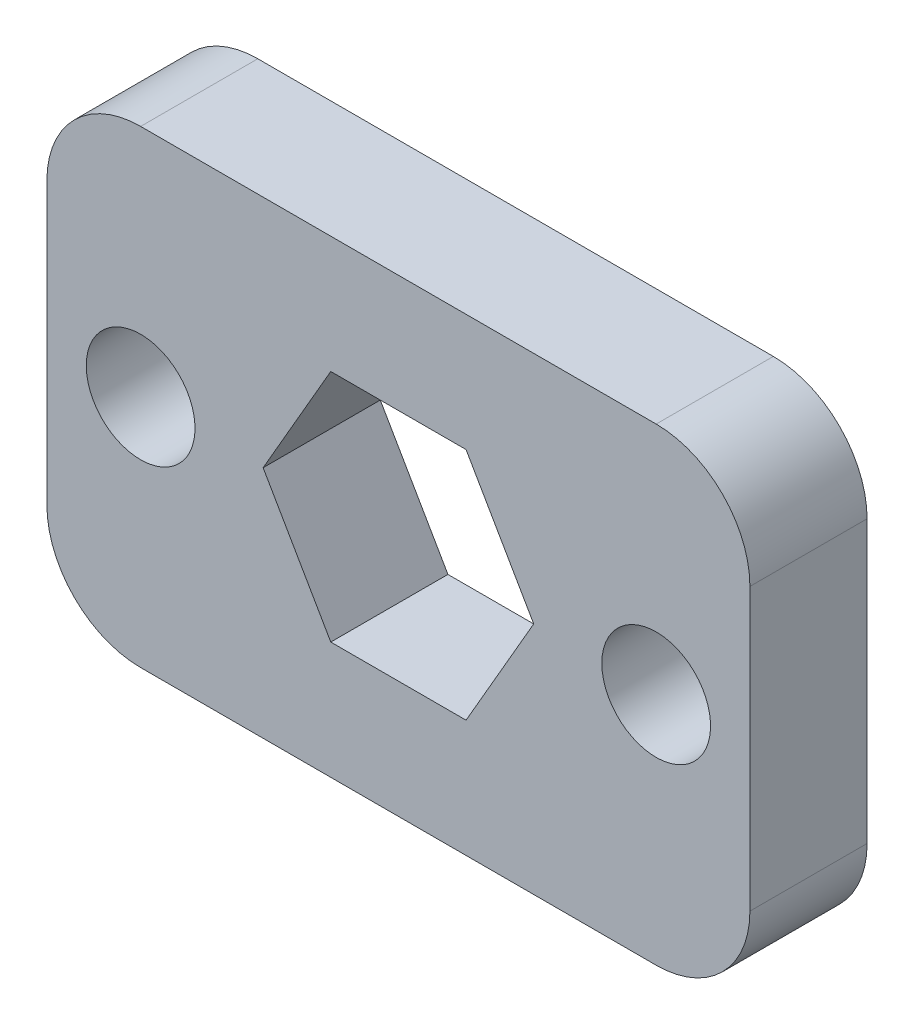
ISO-10303-21;
HEADER;
FILE_DESCRIPTION(('STEP AP214'),'2;1');
FILE_NAME('part.step','',(''),(''),'','','');
FILE_SCHEMA(('AUTOMOTIVE_DESIGN { 1 0 10303 214 1 1 1 1 }'));
ENDSEC;
DATA;
#1=APPLICATION_CONTEXT('core data for automotive mechanical design processes');
#2=APPLICATION_PROTOCOL_DEFINITION('international standard','automotive_design',2000,#1);
#3=PRODUCT_CONTEXT('',#1,'mechanical');
#4=PRODUCT('Part','Part','',(#3));
#5=PRODUCT_RELATED_PRODUCT_CATEGORY('part','',(#4));
#6=PRODUCT_DEFINITION_FORMATION('','',#4);
#7=PRODUCT_DEFINITION_CONTEXT('part definition',#1,'design');
#8=PRODUCT_DEFINITION('design','',#6,#7);
#9=PRODUCT_DEFINITION_SHAPE('','',#8);
#10=(LENGTH_UNIT() NAMED_UNIT(*) SI_UNIT(.MILLI.,.METRE.));
#11=(NAMED_UNIT(*) PLANE_ANGLE_UNIT() SI_UNIT($,.RADIAN.));
#12=(NAMED_UNIT(*) SI_UNIT($,.STERADIAN.) SOLID_ANGLE_UNIT());
#13=UNCERTAINTY_MEASURE_WITH_UNIT(LENGTH_MEASURE(1.E-05),#10,'distance_accuracy_value','');
#14=(GEOMETRIC_REPRESENTATION_CONTEXT(3) GLOBAL_UNCERTAINTY_ASSIGNED_CONTEXT((#13)) GLOBAL_UNIT_ASSIGNED_CONTEXT((#10,
#11,#12)) REPRESENTATION_CONTEXT('',''));
#15=CARTESIAN_POINT('',(0.,0.,0.));
#16=DIRECTION('',(0.,0.,1.));
#17=DIRECTION('',(1.,0.,0.));
#18=AXIS2_PLACEMENT_3D('',#15,#16,#17);
#19=CARTESIAN_POINT('',(0.,0.,-3.175));
#20=DIRECTION('',(0.,0.,1.));
#21=DIRECTION('',(1.,0.,0.));
#22=AXIS2_PLACEMENT_3D('',#19,#20,#21);
#23=PLANE('',#22);
#24=CARTESIAN_POINT('',(-2.54,6.35,-3.175));
#25=DIRECTION('',(0.,0.,-1.));
#26=DIRECTION('',(-1.,0.,0.));
#27=AXIS2_PLACEMENT_3D('',#24,#25,#26);
#28=CIRCLE('',#27,1.47319999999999);
#29=CARTESIAN_POINT('',(-4.01319999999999,6.35,-3.175));
#30=VERTEX_POINT('',#29);
#31=EDGE_CURVE('E454',#30,#30,#28,.T.);
#32=ORIENTED_EDGE('',*,*,#31,.F.);
#33=EDGE_LOOP('',(#32));
#34=FACE_BOUND('',#33,.T.);
#35=CARTESIAN_POINT('',(-16.51,6.35,-3.175));
#36=DIRECTION('',(0.,0.,-1.));
#37=DIRECTION('',(-1.,0.,0.));
#38=AXIS2_PLACEMENT_3D('',#35,#36,#37);
#39=CIRCLE('',#38,1.47319999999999);
#40=CARTESIAN_POINT('',(-17.9832,6.35,-3.175));
#41=VERTEX_POINT('',#40);
#42=EDGE_CURVE('E450',#41,#41,#39,.T.);
#43=ORIENTED_EDGE('',*,*,#42,.F.);
#44=EDGE_LOOP('',(#43));
#45=FACE_BOUND('',#44,.T.);
#46=DIRECTION('',(-1.,0.,0.));
#47=VECTOR('',#46,1.);
#48=CARTESIAN_POINT('',(0.,0.,-3.175));
#49=LINE('',#48,#47);
#50=CARTESIAN_POINT('',(-2.54,0.,-3.175));
#51=VERTEX_POINT('',#50);
#52=CARTESIAN_POINT('',(-16.51,0.,-3.175));
#53=VERTEX_POINT('',#52);
#54=EDGE_CURVE('E200',#51,#53,#49,.T.);
#55=ORIENTED_EDGE('',*,*,#54,.T.);
#56=CARTESIAN_POINT('',(-16.51,2.54,-3.175));
#57=DIRECTION('',(0.,0.,1.));
#58=DIRECTION('',(1.,0.,0.));
#59=AXIS2_PLACEMENT_3D('',#56,#57,#58);
#60=CIRCLE('',#59,2.54);
#61=CARTESIAN_POINT('',(-19.05,2.54,-3.175));
#62=VERTEX_POINT('',#61);
#63=EDGE_CURVE('E240',#53,#62,#60,.F.);
#64=ORIENTED_EDGE('',*,*,#63,.T.);
#65=DIRECTION('',(0.,1.,0.));
#66=VECTOR('',#65,1.);
#67=CARTESIAN_POINT('',(-19.05,0.,-3.175));
#68=LINE('',#67,#66);
#69=CARTESIAN_POINT('',(-19.05,10.16,-3.175));
#70=VERTEX_POINT('',#69);
#71=EDGE_CURVE('E204',#62,#70,#68,.T.);
#72=ORIENTED_EDGE('',*,*,#71,.T.);
#73=CARTESIAN_POINT('',(-16.51,10.16,-3.175));
#74=DIRECTION('',(0.,0.,1.));
#75=DIRECTION('',(1.,0.,0.));
#76=AXIS2_PLACEMENT_3D('',#73,#74,#75);
#77=CIRCLE('',#76,2.54);
#78=CARTESIAN_POINT('',(-16.51,12.7,-3.175));
#79=VERTEX_POINT('',#78);
#80=EDGE_CURVE('E57',#70,#79,#77,.F.);
#81=ORIENTED_EDGE('',*,*,#80,.T.);
#82=DIRECTION('',(1.,0.,0.));
#83=VECTOR('',#82,1.);
#84=CARTESIAN_POINT('',(0.,12.7,-3.175));
#85=LINE('',#84,#83);
#86=CARTESIAN_POINT('',(-2.54,12.7,-3.175));
#87=VERTEX_POINT('',#86);
#88=EDGE_CURVE('E206',#79,#87,#85,.T.);
#89=ORIENTED_EDGE('',*,*,#88,.T.);
#90=CARTESIAN_POINT('',(-2.54,10.16,-3.175));
#91=DIRECTION('',(0.,0.,1.));
#92=DIRECTION('',(1.,0.,0.));
#93=AXIS2_PLACEMENT_3D('',#90,#91,#92);
#94=CIRCLE('',#93,2.54);
#95=CARTESIAN_POINT('',(0.,10.16,-3.175));
#96=VERTEX_POINT('',#95);
#97=EDGE_CURVE('E235',#87,#96,#94,.F.);
#98=ORIENTED_EDGE('',*,*,#97,.T.);
#99=DIRECTION('',(0.,-1.,0.));
#100=VECTOR('',#99,1.);
#101=CARTESIAN_POINT('',(0.,0.,-3.175));
#102=LINE('',#101,#100);
#103=CARTESIAN_POINT('',(0.,2.54,-3.175));
#104=VERTEX_POINT('',#103);
#105=EDGE_CURVE('E197',#96,#104,#102,.T.);
#106=ORIENTED_EDGE('',*,*,#105,.T.);
#107=CARTESIAN_POINT('',(-2.54,2.54,-3.175));
#108=DIRECTION('',(0.,0.,1.));
#109=DIRECTION('',(1.,0.,0.));
#110=AXIS2_PLACEMENT_3D('',#107,#108,#109);
#111=CIRCLE('',#110,2.54);
#112=EDGE_CURVE('E238',#104,#51,#111,.F.);
#113=ORIENTED_EDGE('',*,*,#112,.T.);
#114=EDGE_LOOP('',(#55,#64,#72,#81,#89,#98,#106,#113));
#115=FACE_BOUND('',#114,.T.);
#116=DIRECTION('',(-0.499999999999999,0.866025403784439,0.));
#117=VECTOR('',#116,1.);
#118=CARTESIAN_POINT('',(-11.3580871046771,3.175,-3.175));
#119=LINE('',#118,#117);
#120=CARTESIAN_POINT('',(-11.3580871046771,3.175,-3.175));
#121=VERTEX_POINT('',#120);
#122=CARTESIAN_POINT('',(-13.1911742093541,6.35,-3.175));
#123=VERTEX_POINT('',#122);
#124=EDGE_CURVE('E139',#121,#123,#119,.T.);
#125=ORIENTED_EDGE('',*,*,#124,.F.);
#126=DIRECTION('',(-1.,0.,0.));
#127=VECTOR('',#126,1.);
#128=CARTESIAN_POINT('',(-7.69191289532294,3.175,-3.175));
#129=LINE('',#128,#127);
#130=CARTESIAN_POINT('',(-7.69191289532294,3.175,-3.175));
#131=VERTEX_POINT('',#130);
#132=EDGE_CURVE('E172',#131,#121,#129,.T.);
#133=ORIENTED_EDGE('',*,*,#132,.F.);
#134=DIRECTION('',(-0.5,-0.866025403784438,0.));
#135=VECTOR('',#134,1.);
#136=CARTESIAN_POINT('',(-5.85882579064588,6.35,-3.175));
#137=LINE('',#136,#135);
#138=CARTESIAN_POINT('',(-5.85882579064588,6.35,-3.175));
#139=VERTEX_POINT('',#138);
#140=EDGE_CURVE('E169',#139,#131,#137,.T.);
#141=ORIENTED_EDGE('',*,*,#140,.F.);
#142=DIRECTION('',(0.499999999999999,-0.866025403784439,0.));
#143=VECTOR('',#142,1.);
#144=CARTESIAN_POINT('',(-7.69191289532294,9.525,-3.175));
#145=LINE('',#144,#143);
#146=CARTESIAN_POINT('',(-7.69191289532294,9.525,-3.175));
#147=VERTEX_POINT('',#146);
#148=EDGE_CURVE('E164',#147,#139,#145,.T.);
#149=ORIENTED_EDGE('',*,*,#148,.F.);
#150=DIRECTION('',(1.,0.,0.));
#151=VECTOR('',#150,1.);
#152=CARTESIAN_POINT('',(-11.3580871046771,9.525,-3.175));
#153=LINE('',#152,#151);
#154=CARTESIAN_POINT('',(-11.3580871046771,9.525,-3.175));
#155=VERTEX_POINT('',#154);
#156=EDGE_CURVE('E162',#155,#147,#153,.T.);
#157=ORIENTED_EDGE('',*,*,#156,.F.);
#158=DIRECTION('',(0.500000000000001,0.866025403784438,0.));
#159=VECTOR('',#158,1.);
#160=CARTESIAN_POINT('',(-13.1911742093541,6.35,-3.175));
#161=LINE('',#160,#159);
#162=EDGE_CURVE('E149',#123,#155,#161,.T.);
#163=ORIENTED_EDGE('',*,*,#162,.F.);
#164=EDGE_LOOP('',(#125,#133,#141,#149,#157,#163));
#165=FACE_BOUND('',#164,.T.);
#166=ADVANCED_FACE('F36',(#34,#45,#115,#165),#23,.F.);
#167=CARTESIAN_POINT('',(0.,0.,0.));
#168=DIRECTION('',(0.,0.,1.));
#169=DIRECTION('',(1.,0.,0.));
#170=AXIS2_PLACEMENT_3D('',#167,#168,#169);
#171=PLANE('',#170);
#172=CARTESIAN_POINT('',(-2.54,6.35,0.));
#173=DIRECTION('',(0.,0.,-1.));
#174=DIRECTION('',(-1.,0.,0.));
#175=AXIS2_PLACEMENT_3D('',#172,#173,#174);
#176=CIRCLE('',#175,1.4732);
#177=CARTESIAN_POINT('',(-4.0132,6.35,0.));
#178=VERTEX_POINT('',#177);
#179=EDGE_CURVE('E451',#178,#178,#176,.T.);
#180=ORIENTED_EDGE('',*,*,#179,.T.);
#181=EDGE_LOOP('',(#180));
#182=FACE_BOUND('',#181,.T.);
#183=CARTESIAN_POINT('',(-16.51,6.35,0.));
#184=DIRECTION('',(0.,0.,-1.));
#185=DIRECTION('',(-1.,0.,0.));
#186=AXIS2_PLACEMENT_3D('',#183,#184,#185);
#187=CIRCLE('',#186,1.4732);
#188=CARTESIAN_POINT('',(-17.9832,6.35,0.));
#189=VERTEX_POINT('',#188);
#190=EDGE_CURVE('E176',#189,#189,#187,.T.);
#191=ORIENTED_EDGE('',*,*,#190,.T.);
#192=EDGE_LOOP('',(#191));
#193=FACE_BOUND('',#192,.T.);
#194=DIRECTION('',(0.,1.,0.));
#195=VECTOR('',#194,1.);
#196=CARTESIAN_POINT('',(-19.05,0.,0.));
#197=LINE('',#196,#195);
#198=CARTESIAN_POINT('',(-19.05,2.54,0.));
#199=VERTEX_POINT('',#198);
#200=CARTESIAN_POINT('',(-19.05,10.16,0.));
#201=VERTEX_POINT('',#200);
#202=EDGE_CURVE('E214',#199,#201,#197,.T.);
#203=ORIENTED_EDGE('',*,*,#202,.F.);
#204=CARTESIAN_POINT('',(-16.51,2.54,0.));
#205=DIRECTION('',(0.,0.,1.));
#206=DIRECTION('',(1.,0.,0.));
#207=AXIS2_PLACEMENT_3D('',#204,#205,#206);
#208=CIRCLE('',#207,2.54);
#209=CARTESIAN_POINT('',(-16.51,0.,0.));
#210=VERTEX_POINT('',#209);
#211=EDGE_CURVE('E228',#199,#210,#208,.T.);
#212=ORIENTED_EDGE('',*,*,#211,.T.);
#213=DIRECTION('',(-1.,0.,0.));
#214=VECTOR('',#213,1.);
#215=CARTESIAN_POINT('',(0.,0.,0.));
#216=LINE('',#215,#214);
#217=CARTESIAN_POINT('',(-2.54,0.,0.));
#218=VERTEX_POINT('',#217);
#219=EDGE_CURVE('E211',#218,#210,#216,.T.);
#220=ORIENTED_EDGE('',*,*,#219,.F.);
#221=CARTESIAN_POINT('',(-2.54,2.54,0.));
#222=DIRECTION('',(0.,0.,1.));
#223=DIRECTION('',(1.,0.,0.));
#224=AXIS2_PLACEMENT_3D('',#221,#222,#223);
#225=CIRCLE('',#224,2.54);
#226=CARTESIAN_POINT('',(0.,2.54,0.));
#227=VERTEX_POINT('',#226);
#228=EDGE_CURVE('E226',#218,#227,#225,.T.);
#229=ORIENTED_EDGE('',*,*,#228,.T.);
#230=DIRECTION('',(0.,-1.,0.));
#231=VECTOR('',#230,1.);
#232=CARTESIAN_POINT('',(0.,0.,0.));
#233=LINE('',#232,#231);
#234=CARTESIAN_POINT('',(0.,10.16,0.));
#235=VERTEX_POINT('',#234);
#236=EDGE_CURVE('E157',#235,#227,#233,.T.);
#237=ORIENTED_EDGE('',*,*,#236,.F.);
#238=CARTESIAN_POINT('',(-2.54,10.16,0.));
#239=DIRECTION('',(0.,0.,1.));
#240=DIRECTION('',(1.,0.,0.));
#241=AXIS2_PLACEMENT_3D('',#238,#239,#240);
#242=CIRCLE('',#241,2.54);
#243=CARTESIAN_POINT('',(-2.54,12.7,0.));
#244=VERTEX_POINT('',#243);
#245=EDGE_CURVE('E222',#235,#244,#242,.T.);
#246=ORIENTED_EDGE('',*,*,#245,.T.);
#247=DIRECTION('',(1.,0.,0.));
#248=VECTOR('',#247,1.);
#249=CARTESIAN_POINT('',(0.,12.7,0.));
#250=LINE('',#249,#248);
#251=CARTESIAN_POINT('',(-16.51,12.7,0.));
#252=VERTEX_POINT('',#251);
#253=EDGE_CURVE('E201',#252,#244,#250,.T.);
#254=ORIENTED_EDGE('',*,*,#253,.F.);
#255=CARTESIAN_POINT('',(-16.51,10.16,0.));
#256=DIRECTION('',(0.,0.,1.));
#257=DIRECTION('',(1.,0.,0.));
#258=AXIS2_PLACEMENT_3D('',#255,#256,#257);
#259=CIRCLE('',#258,2.54);
#260=EDGE_CURVE('E224',#252,#201,#259,.T.);
#261=ORIENTED_EDGE('',*,*,#260,.T.);
#262=EDGE_LOOP('',(#203,#212,#220,#229,#237,#246,#254,#261));
#263=FACE_BOUND('',#262,.T.);
#264=DIRECTION('',(-1.,0.,0.));
#265=VECTOR('',#264,1.);
#266=CARTESIAN_POINT('',(-7.69191289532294,3.175,0.));
#267=LINE('',#266,#265);
#268=CARTESIAN_POINT('',(-7.69191289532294,3.175,0.));
#269=VERTEX_POINT('',#268);
#270=CARTESIAN_POINT('',(-11.3580871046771,3.175,0.));
#271=VERTEX_POINT('',#270);
#272=EDGE_CURVE('E150',#269,#271,#267,.T.);
#273=ORIENTED_EDGE('',*,*,#272,.T.);
#274=DIRECTION('',(-0.499999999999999,0.866025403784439,0.));
#275=VECTOR('',#274,1.);
#276=CARTESIAN_POINT('',(-11.3580871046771,3.175,0.));
#277=LINE('',#276,#275);
#278=CARTESIAN_POINT('',(-13.1911742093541,6.35,0.));
#279=VERTEX_POINT('',#278);
#280=EDGE_CURVE('E174',#271,#279,#277,.T.);
#281=ORIENTED_EDGE('',*,*,#280,.T.);
#282=DIRECTION('',(0.500000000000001,0.866025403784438,0.));
#283=VECTOR('',#282,1.);
#284=CARTESIAN_POINT('',(-13.1911742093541,6.35,0.));
#285=LINE('',#284,#283);
#286=CARTESIAN_POINT('',(-11.3580871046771,9.525,0.));
#287=VERTEX_POINT('',#286);
#288=EDGE_CURVE('E156',#279,#287,#285,.T.);
#289=ORIENTED_EDGE('',*,*,#288,.T.);
#290=DIRECTION('',(1.,0.,0.));
#291=VECTOR('',#290,1.);
#292=CARTESIAN_POINT('',(-11.3580871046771,9.525,0.));
#293=LINE('',#292,#291);
#294=CARTESIAN_POINT('',(-7.69191289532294,9.525,0.));
#295=VERTEX_POINT('',#294);
#296=EDGE_CURVE('E178',#287,#295,#293,.T.);
#297=ORIENTED_EDGE('',*,*,#296,.T.);
#298=DIRECTION('',(0.499999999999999,-0.866025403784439,0.));
#299=VECTOR('',#298,1.);
#300=CARTESIAN_POINT('',(-7.69191289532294,9.525,0.));
#301=LINE('',#300,#299);
#302=CARTESIAN_POINT('',(-5.85882579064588,6.35,0.));
#303=VERTEX_POINT('',#302);
#304=EDGE_CURVE('E181',#295,#303,#301,.T.);
#305=ORIENTED_EDGE('',*,*,#304,.T.);
#306=DIRECTION('',(-0.5,-0.866025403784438,0.));
#307=VECTOR('',#306,1.);
#308=CARTESIAN_POINT('',(-5.85882579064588,6.35,0.));
#309=LINE('',#308,#307);
#310=EDGE_CURVE('E184',#303,#269,#309,.T.);
#311=ORIENTED_EDGE('',*,*,#310,.T.);
#312=EDGE_LOOP('',(#273,#281,#289,#297,#305,#311));
#313=FACE_BOUND('',#312,.T.);
#314=ADVANCED_FACE('F264',(#182,#193,#263,#313),#171,.T.);
#315=CARTESIAN_POINT('',(0.,0.,-3.175));
#316=DIRECTION('',(-1.,0.,0.));
#317=DIRECTION('',(0.,0.,1.));
#318=AXIS2_PLACEMENT_3D('',#315,#316,#317);
#319=PLANE('',#318);
#320=ORIENTED_EDGE('',*,*,#236,.T.);
#321=DIRECTION('',(0.,0.,1.));
#322=VECTOR('',#321,1.);
#323=CARTESIAN_POINT('',(0.,2.54,-3.175));
#324=LINE('',#323,#322);
#325=EDGE_CURVE('E245',#227,#104,#324,.F.);
#326=ORIENTED_EDGE('',*,*,#325,.T.);
#327=ORIENTED_EDGE('',*,*,#105,.F.);
#328=DIRECTION('',(0.,0.,1.));
#329=VECTOR('',#328,1.);
#330=CARTESIAN_POINT('',(0.,10.16,-3.175));
#331=LINE('',#330,#329);
#332=EDGE_CURVE('E242',#96,#235,#331,.T.);
#333=ORIENTED_EDGE('',*,*,#332,.T.);
#334=EDGE_LOOP('',(#320,#326,#327,#333));
#335=FACE_BOUND('',#334,.T.);
#336=ADVANCED_FACE('F249',(#335),#319,.F.);
#337=CARTESIAN_POINT('',(0.,0.,-3.175));
#338=DIRECTION('',(0.,1.,0.));
#339=DIRECTION('',(0.,0.,1.));
#340=AXIS2_PLACEMENT_3D('',#337,#338,#339);
#341=PLANE('',#340);
#342=ORIENTED_EDGE('',*,*,#219,.T.);
#343=DIRECTION('',(0.,0.,1.));
#344=VECTOR('',#343,1.);
#345=CARTESIAN_POINT('',(-16.51,0.,-3.175));
#346=LINE('',#345,#344);
#347=EDGE_CURVE('E233',#210,#53,#346,.F.);
#348=ORIENTED_EDGE('',*,*,#347,.T.);
#349=ORIENTED_EDGE('',*,*,#54,.F.);
#350=DIRECTION('',(0.,0.,1.));
#351=VECTOR('',#350,1.);
#352=CARTESIAN_POINT('',(-2.54,0.,-3.175));
#353=LINE('',#352,#351);
#354=EDGE_CURVE('E230',#51,#218,#353,.T.);
#355=ORIENTED_EDGE('',*,*,#354,.T.);
#356=EDGE_LOOP('',(#342,#348,#349,#355));
#357=FACE_BOUND('',#356,.T.);
#358=ADVANCED_FACE('F260',(#357),#341,.F.);
#359=CARTESIAN_POINT('',(-19.05,0.,-3.175));
#360=DIRECTION('',(1.,0.,0.));
#361=DIRECTION('',(0.,0.,-1.));
#362=AXIS2_PLACEMENT_3D('',#359,#360,#361);
#363=PLANE('',#362);
#364=ORIENTED_EDGE('',*,*,#71,.F.);
#365=DIRECTION('',(0.,0.,1.));
#366=VECTOR('',#365,1.);
#367=CARTESIAN_POINT('',(-19.05,2.54,-3.175));
#368=LINE('',#367,#366);
#369=EDGE_CURVE('E219',#62,#199,#368,.T.);
#370=ORIENTED_EDGE('',*,*,#369,.T.);
#371=ORIENTED_EDGE('',*,*,#202,.T.);
#372=DIRECTION('',(0.,0.,1.));
#373=VECTOR('',#372,1.);
#374=CARTESIAN_POINT('',(-19.05,10.16,-3.175));
#375=LINE('',#374,#373);
#376=EDGE_CURVE('E208',#201,#70,#375,.F.);
#377=ORIENTED_EDGE('',*,*,#376,.T.);
#378=EDGE_LOOP('',(#364,#370,#371,#377));
#379=FACE_BOUND('',#378,.T.);
#380=ADVANCED_FACE('F272',(#379),#363,.F.);
#381=CARTESIAN_POINT('',(0.,12.7,-3.175));
#382=DIRECTION('',(0.,-1.,0.));
#383=DIRECTION('',(0.,0.,-1.));
#384=AXIS2_PLACEMENT_3D('',#381,#382,#383);
#385=PLANE('',#384);
#386=ORIENTED_EDGE('',*,*,#88,.F.);
#387=DIRECTION('',(0.,0.,1.));
#388=VECTOR('',#387,1.);
#389=CARTESIAN_POINT('',(-16.51,12.7,-3.175));
#390=LINE('',#389,#388);
#391=EDGE_CURVE('E11',#79,#252,#390,.T.);
#392=ORIENTED_EDGE('',*,*,#391,.T.);
#393=ORIENTED_EDGE('',*,*,#253,.T.);
#394=DIRECTION('',(0.,0.,1.));
#395=VECTOR('',#394,1.);
#396=CARTESIAN_POINT('',(-2.54,12.7,-3.175));
#397=LINE('',#396,#395);
#398=EDGE_CURVE('E44',#244,#87,#397,.F.);
#399=ORIENTED_EDGE('',*,*,#398,.T.);
#400=EDGE_LOOP('',(#386,#392,#393,#399));
#401=FACE_BOUND('',#400,.T.);
#402=ADVANCED_FACE('F278',(#401),#385,.F.);
#403=CARTESIAN_POINT('',(-11.3580871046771,3.175,-3.175));
#404=DIRECTION('',(0.866025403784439,0.499999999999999,0.));
#405=DIRECTION('',(-0.499999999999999,0.866025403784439,0.));
#406=AXIS2_PLACEMENT_3D('',#403,#404,#405);
#407=PLANE('',#406);
#408=ORIENTED_EDGE('',*,*,#280,.F.);
#409=DIRECTION('',(0.,0.,1.));
#410=VECTOR('',#409,1.);
#411=CARTESIAN_POINT('',(-11.3580871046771,3.175,-3.175));
#412=LINE('',#411,#410);
#413=EDGE_CURVE('E145',#121,#271,#412,.T.);
#414=ORIENTED_EDGE('',*,*,#413,.F.);
#415=ORIENTED_EDGE('',*,*,#124,.T.);
#416=DIRECTION('',(0.,0.,1.));
#417=VECTOR('',#416,1.);
#418=CARTESIAN_POINT('',(-13.1911742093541,6.35,-3.175));
#419=LINE('',#418,#417);
#420=EDGE_CURVE('E142',#123,#279,#419,.T.);
#421=ORIENTED_EDGE('',*,*,#420,.T.);
#422=EDGE_LOOP('',(#408,#414,#415,#421));
#423=FACE_BOUND('',#422,.T.);
#424=ADVANCED_FACE('F141',(#423),#407,.T.);
#425=CARTESIAN_POINT('',(-13.1911742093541,6.35,-3.175));
#426=DIRECTION('',(0.866025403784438,-0.500000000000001,0.));
#427=DIRECTION('',(0.500000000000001,0.866025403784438,0.));
#428=AXIS2_PLACEMENT_3D('',#425,#426,#427);
#429=PLANE('',#428);
#430=ORIENTED_EDGE('',*,*,#288,.F.);
#431=ORIENTED_EDGE('',*,*,#420,.F.);
#432=ORIENTED_EDGE('',*,*,#162,.T.);
#433=DIRECTION('',(0.,0.,1.));
#434=VECTOR('',#433,1.);
#435=CARTESIAN_POINT('',(-11.3580871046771,9.525,-3.175));
#436=LINE('',#435,#434);
#437=EDGE_CURVE('E158',#155,#287,#436,.T.);
#438=ORIENTED_EDGE('',*,*,#437,.T.);
#439=EDGE_LOOP('',(#430,#431,#432,#438));
#440=FACE_BOUND('',#439,.T.);
#441=ADVANCED_FACE('F153',(#440),#429,.T.);
#442=CARTESIAN_POINT('',(-11.3580871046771,9.525,-3.175));
#443=DIRECTION('',(0.,-1.,0.));
#444=DIRECTION('',(0.,0.,-1.));
#445=AXIS2_PLACEMENT_3D('',#442,#443,#444);
#446=PLANE('',#445);
#447=ORIENTED_EDGE('',*,*,#296,.F.);
#448=ORIENTED_EDGE('',*,*,#437,.F.);
#449=ORIENTED_EDGE('',*,*,#156,.T.);
#450=DIRECTION('',(0.,0.,1.));
#451=VECTOR('',#450,1.);
#452=CARTESIAN_POINT('',(-7.69191289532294,9.525,-3.175));
#453=LINE('',#452,#451);
#454=EDGE_CURVE('E194',#147,#295,#453,.T.);
#455=ORIENTED_EDGE('',*,*,#454,.T.);
#456=EDGE_LOOP('',(#447,#448,#449,#455));
#457=FACE_BOUND('',#456,.T.);
#458=ADVANCED_FACE('F374',(#457),#446,.T.);
#459=CARTESIAN_POINT('',(-7.69191289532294,9.525,-3.175));
#460=DIRECTION('',(-0.866025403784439,-0.499999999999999,0.));
#461=DIRECTION('',(0.5,-0.866025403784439,0.));
#462=AXIS2_PLACEMENT_3D('',#459,#460,#461);
#463=PLANE('',#462);
#464=ORIENTED_EDGE('',*,*,#304,.F.);
#465=ORIENTED_EDGE('',*,*,#454,.F.);
#466=ORIENTED_EDGE('',*,*,#148,.T.);
#467=DIRECTION('',(0.,0.,1.));
#468=VECTOR('',#467,1.);
#469=CARTESIAN_POINT('',(-5.85882579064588,6.35,-3.175));
#470=LINE('',#469,#468);
#471=EDGE_CURVE('E192',#139,#303,#470,.T.);
#472=ORIENTED_EDGE('',*,*,#471,.T.);
#473=EDGE_LOOP('',(#464,#465,#466,#472));
#474=FACE_BOUND('',#473,.T.);
#475=ADVANCED_FACE('F365',(#474),#463,.T.);
#476=CARTESIAN_POINT('',(-5.85882579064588,6.35,-3.175));
#477=DIRECTION('',(-0.866025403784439,0.5,0.));
#478=DIRECTION('',(-0.5,-0.866025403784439,0.));
#479=AXIS2_PLACEMENT_3D('',#476,#477,#478);
#480=PLANE('',#479);
#481=ORIENTED_EDGE('',*,*,#310,.F.);
#482=ORIENTED_EDGE('',*,*,#471,.F.);
#483=ORIENTED_EDGE('',*,*,#140,.T.);
#484=DIRECTION('',(0.,0.,1.));
#485=VECTOR('',#484,1.);
#486=CARTESIAN_POINT('',(-7.69191289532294,3.175,-3.175));
#487=LINE('',#486,#485);
#488=EDGE_CURVE('E190',#131,#269,#487,.T.);
#489=ORIENTED_EDGE('',*,*,#488,.T.);
#490=EDGE_LOOP('',(#481,#482,#483,#489));
#491=FACE_BOUND('',#490,.T.);
#492=ADVANCED_FACE('F356',(#491),#480,.T.);
#493=CARTESIAN_POINT('',(-7.69191289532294,3.175,-3.175));
#494=DIRECTION('',(0.,1.,0.));
#495=DIRECTION('',(-1.,0.,0.));
#496=AXIS2_PLACEMENT_3D('',#493,#494,#495);
#497=PLANE('',#496);
#498=ORIENTED_EDGE('',*,*,#272,.F.);
#499=ORIENTED_EDGE('',*,*,#488,.F.);
#500=ORIENTED_EDGE('',*,*,#132,.T.);
#501=ORIENTED_EDGE('',*,*,#413,.T.);
#502=EDGE_LOOP('',(#498,#499,#500,#501));
#503=FACE_BOUND('',#502,.T.);
#504=ADVANCED_FACE('F347',(#503),#497,.T.);
#505=CARTESIAN_POINT('',(-16.51,6.35,-3.175));
#506=DIRECTION('',(0.,0.,-1.));
#507=DIRECTION('',(-1.,0.,0.));
#508=AXIS2_PLACEMENT_3D('',#505,#506,#507);
#509=CYLINDRICAL_SURFACE('',#508,1.47319999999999);
#510=ORIENTED_EDGE('',*,*,#190,.F.);
#511=EDGE_LOOP('',(#510));
#512=FACE_BOUND('',#511,.T.);
#513=ORIENTED_EDGE('',*,*,#42,.T.);
#514=EDGE_LOOP('',(#513));
#515=FACE_BOUND('',#514,.T.);
#516=ADVANCED_FACE('F338',(#512,#515),#509,.F.);
#517=CARTESIAN_POINT('',(-2.54,6.35,-3.175));
#518=DIRECTION('',(0.,0.,-1.));
#519=DIRECTION('',(-1.,0.,0.));
#520=AXIS2_PLACEMENT_3D('',#517,#518,#519);
#521=CYLINDRICAL_SURFACE('',#520,1.47319999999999);
#522=ORIENTED_EDGE('',*,*,#179,.F.);
#523=EDGE_LOOP('',(#522));
#524=FACE_BOUND('',#523,.T.);
#525=ORIENTED_EDGE('',*,*,#31,.T.);
#526=EDGE_LOOP('',(#525));
#527=FACE_BOUND('',#526,.T.);
#528=ADVANCED_FACE('F307',(#524,#527),#521,.F.);
#529=CARTESIAN_POINT('',(-16.51,2.54,-3.175));
#530=DIRECTION('',(0.,0.,1.));
#531=DIRECTION('',(1.,0.,0.));
#532=AXIS2_PLACEMENT_3D('',#529,#530,#531);
#533=CYLINDRICAL_SURFACE('',#532,2.54);
#534=ORIENTED_EDGE('',*,*,#63,.F.);
#535=ORIENTED_EDGE('',*,*,#347,.F.);
#536=ORIENTED_EDGE('',*,*,#211,.F.);
#537=ORIENTED_EDGE('',*,*,#369,.F.);
#538=EDGE_LOOP('',(#534,#535,#536,#537));
#539=FACE_BOUND('',#538,.T.);
#540=ADVANCED_FACE('F269',(#539),#533,.T.);
#541=CARTESIAN_POINT('',(-2.54,2.54,-3.175));
#542=DIRECTION('',(0.,0.,1.));
#543=DIRECTION('',(1.,0.,0.));
#544=AXIS2_PLACEMENT_3D('',#541,#542,#543);
#545=CYLINDRICAL_SURFACE('',#544,2.54);
#546=ORIENTED_EDGE('',*,*,#112,.F.);
#547=ORIENTED_EDGE('',*,*,#325,.F.);
#548=ORIENTED_EDGE('',*,*,#228,.F.);
#549=ORIENTED_EDGE('',*,*,#354,.F.);
#550=EDGE_LOOP('',(#546,#547,#548,#549));
#551=FACE_BOUND('',#550,.T.);
#552=ADVANCED_FACE('F257',(#551),#545,.T.);
#553=CARTESIAN_POINT('',(-16.51,10.16,-3.175));
#554=DIRECTION('',(0.,0.,1.));
#555=DIRECTION('',(1.,0.,0.));
#556=AXIS2_PLACEMENT_3D('',#553,#554,#555);
#557=CYLINDRICAL_SURFACE('',#556,2.54);
#558=ORIENTED_EDGE('',*,*,#80,.F.);
#559=ORIENTED_EDGE('',*,*,#376,.F.);
#560=ORIENTED_EDGE('',*,*,#260,.F.);
#561=ORIENTED_EDGE('',*,*,#391,.F.);
#562=EDGE_LOOP('',(#558,#559,#560,#561));
#563=FACE_BOUND('',#562,.T.);
#564=ADVANCED_FACE('F276',(#563),#557,.T.);
#565=CARTESIAN_POINT('',(-2.54,10.16,-3.175));
#566=DIRECTION('',(0.,0.,1.));
#567=DIRECTION('',(1.,0.,0.));
#568=AXIS2_PLACEMENT_3D('',#565,#566,#567);
#569=CYLINDRICAL_SURFACE('',#568,2.54);
#570=ORIENTED_EDGE('',*,*,#97,.F.);
#571=ORIENTED_EDGE('',*,*,#398,.F.);
#572=ORIENTED_EDGE('',*,*,#245,.F.);
#573=ORIENTED_EDGE('',*,*,#332,.F.);
#574=EDGE_LOOP('',(#570,#571,#572,#573));
#575=FACE_BOUND('',#574,.T.);
#576=ADVANCED_FACE('F38',(#575),#569,.T.);
#577=CLOSED_SHELL('',(#166,#314,#336,#358,#380,#402,#424,#441,#458,#475,#492,#504,#516,#528,
#540,#552,#564,#576));
#578=MANIFOLD_SOLID_BREP('B2',#577);
#579=ADVANCED_BREP_SHAPE_REPRESENTATION('',(#18,#578),#14);
#580=SHAPE_DEFINITION_REPRESENTATION(#9,#579);
ENDSEC;
END-ISO-10303-21;
